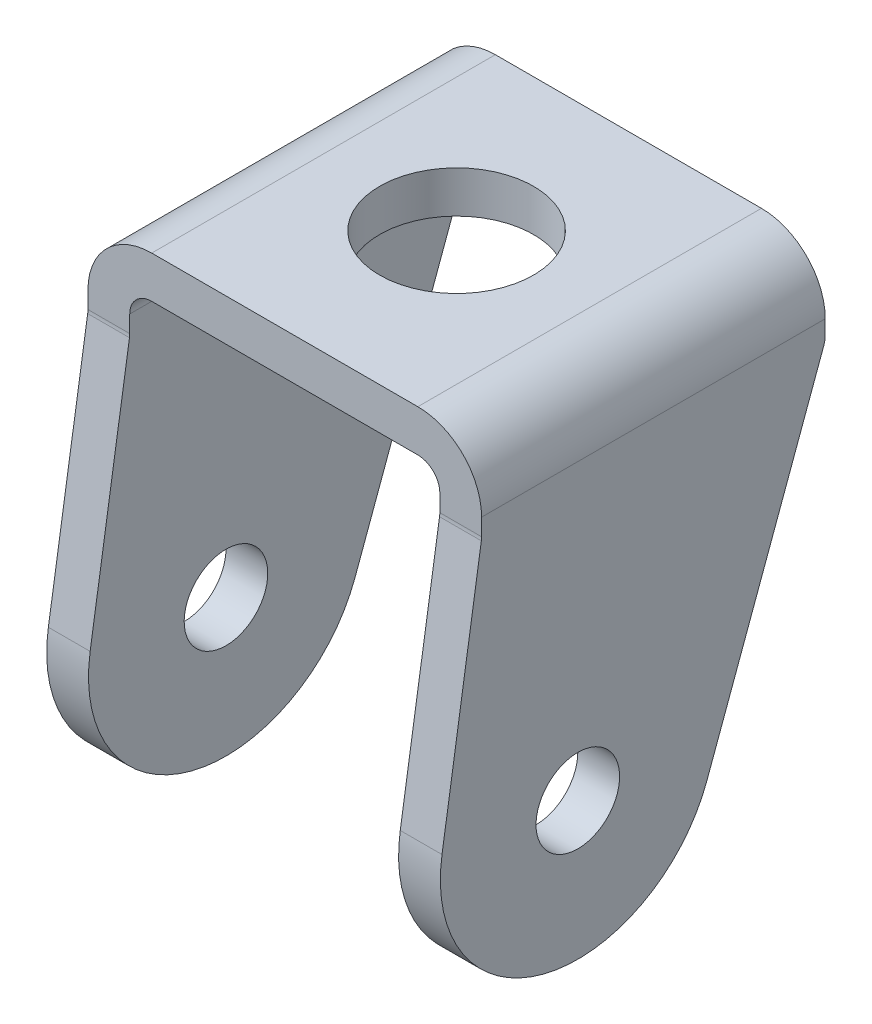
from build123d import *

# Parameters (mm, degrees)
EXTRUDE_THIN2_DEPTH = 44.45
CUT_EXTRUDE3_DEPTH  = 86.49317023
SKETCH4_R           = 4.826
CUT_EXTRUDE4_DEPTH  = 86.49317023
SKETCH5_R           = 8.89
CUT_EXTRUDE5_DEPTH  = 86.49317023
FILLET1_R           = 2.54
FILLET2_R           = 7.366


with BuildPart() as part:
    # Sketch1 → Extrude-Thin2 (new body)
    with BuildSketch(Plane.XY):
        Polygon((0, -57.15), (0, 0), (45.466, 0), (45.466, -57.15), (40.64, -57.15), (40.64, -4.826), (4.826, -4.826), (4.826, -57.15), align=None)
    extrude(amount=EXTRUDE_THIN2_DEPTH)

    # Sketch3 → Cut-Extrude3 (cut, through all)
    with BuildSketch(Plane(origin=(45.466, 0, 0), x_dir=(0, 0, -1), z_dir=(1, 0, 0))):
        with BuildLine():
            Line((-39.6875, -9.525), (-39.6875, 0))
            Line((-39.6875, 0), (-44.45, 0))
            Line((-44.45, 0), (-44.45, -41.275))
            ThreePointArc((-44.45, -41.275), (-44.402470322, -40.047478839), (-44.260165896, -38.827308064))
            Line((-44.260165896, -38.827308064), (-39.6875, -9.525))
        make_face()
        with BuildLine():
            Line((-44.45, -57.15), (-28.575, -57.15))
            ThreePointArc((-28.575, -57.15), (-39.800320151, -52.500320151), (-44.45, -41.275))
            Line((-44.45, -41.275), (-44.45, -57.15))
        make_face()
        with BuildLine():
            Line((0, -57.15), (0, -9.525))
            Line((0, -9.525), (-13.673553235, -46.748802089))
            ThreePointArc((-13.673553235, -46.748802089), (-19.488773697, -54.292531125), (-28.575, -57.15))
            Line((-28.575, -57.15), (0, -57.15))
        make_face()
    extrude(amount=-CUT_EXTRUDE3_DEPTH, mode=Mode.SUBTRACT)

    # Sketch4 → Cut-Extrude4 (cut, through all)
    with BuildSketch(Plane.ZY):
        with Locations(Location((28.575, -41.275, 0), (0, 0, 270))):
            Circle(SKETCH4_R)
    extrude(amount=-CUT_EXTRUDE4_DEPTH, mode=Mode.SUBTRACT)

    # Sketch5 → Cut-Extrude5 (cut, through all)
    with BuildSketch(Plane(origin=(0, 0, 0), x_dir=(-1, 0, 0), z_dir=(0, 1, 0))):
        with Locations(Location((-22.733, 19.84375, 0), (0, 0, 90))):
            Circle(SKETCH5_R)
    extrude(amount=-CUT_EXTRUDE5_DEPTH, mode=Mode.SUBTRACT)

    # Fillet1
    fillet1_edges = [part.edges().sort_by_distance(p)[0] for p in [
        (40.64, -4.826, 19.84375),
        (4.826, -4.826, 19.84375),
        (43.053, -9.525, 39.6875),
        (2.413, -9.525, 39.6875),
        (43.053, -9.525, 0),
        (2.413, -9.525, 0),
    ]]
    fillet(fillet1_edges, radius=FILLET1_R)

    # Fillet2
    fillet2_edges = [part.edges().sort_by_distance(p)[0] for p in [
        (0, 0, 19.84375),
        (45.466, 0, 19.84375),
    ]]
    fillet(fillet2_edges, radius=FILLET2_R)


solid = part.part
